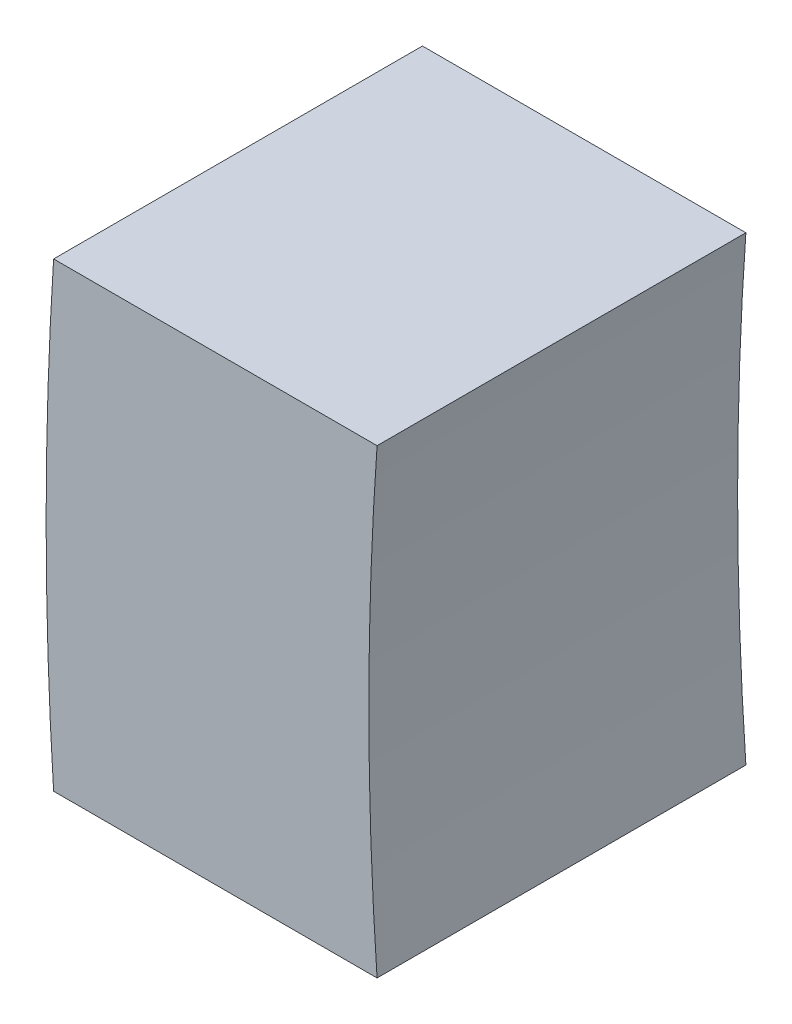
from build123d import *

# Parameters (mm, degrees)
EXTRUSION1_DEPTH = 8


with BuildPart() as part:
    # Esquisse2 → Extrusion1 (new body)
    with BuildSketch(Plane.XY):
        with BuildLine():
            Line((-76.837490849, 5), (-69.821200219, 5))
            ThreePointArc((-69.821200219, 5), (-70, 0), (-69.821200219, -5))
            Line((-69.821200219, -5), (-76.837490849, -5))
            ThreePointArc((-76.837490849, -5), (-77, 0), (-76.837490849, 5))
        make_face()
    extrude(amount=EXTRUSION1_DEPTH)


solid = part.part
